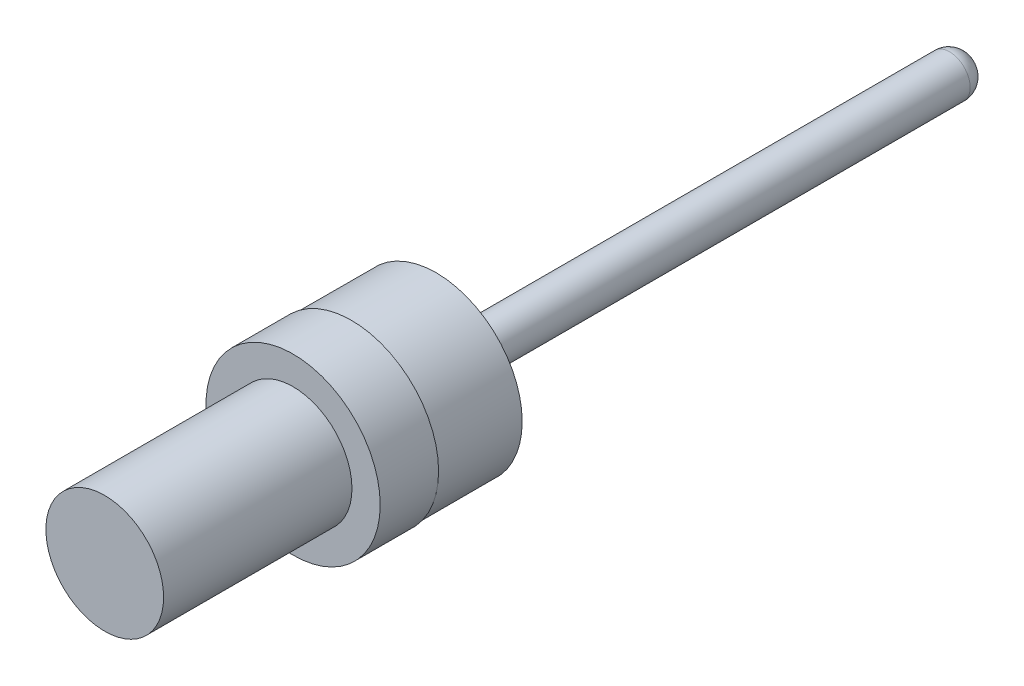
from build123d import *

# Parameters (mm, degrees)
SKETCH1_R           = 4.699
BASE_EXTRUDE_DEPTH  = 3.1496
SKETCH2_R           = 4.6355
RUBBER_DEPTH        = 4.572
SKETCH3_R           = 1.1176
BOSS_EXTRUDE2_DEPTH = 28.702
FILLET1_R           = 1.016
SKETCH4_R           = 3.175
BOSS_EXTRUDE3_DEPTH = 10.16


with BuildPart() as part:
    # Sketch1 → Base-Extrude (new body)
    with BuildSketch(Plane.XY):
        Circle(SKETCH1_R)
    extrude(amount=BASE_EXTRUDE_DEPTH)

    # Sketch2 → rubber (add)
    with BuildSketch(Plane(origin=(0, 0, 0), x_dir=(-1, 0, 0), z_dir=(0, 0, -1))):
        with Locations(Location((0, 0, 0), (0, 0, 180))):
            Circle(SKETCH2_R)
    extrude(amount=RUBBER_DEPTH)

    # Sketch3 → Boss-Extrude2 (add)
    with BuildSketch(Plane(origin=(0, 0, -4.572), x_dir=(-1, 0, 0), z_dir=(0, 0, -1))):
        with Locations(Location((0, 0, 0), (0, 0, 180))):
            Circle(SKETCH3_R)
    extrude(amount=BOSS_EXTRUDE2_DEPTH)

    # Fillet1
    fillet1_edges = [part.edges().sort_by_distance(p)[0] for p in [
        (-1.1176, 0, -33.274),
    ]]
    fillet(fillet1_edges, radius=FILLET1_R)

    # Sketch4 → Boss-Extrude3 (add)
    with BuildSketch(Plane.XY.offset(3.1496)):
        Circle(SKETCH4_R)
    extrude(amount=BOSS_EXTRUDE3_DEPTH)


solid = part.part
